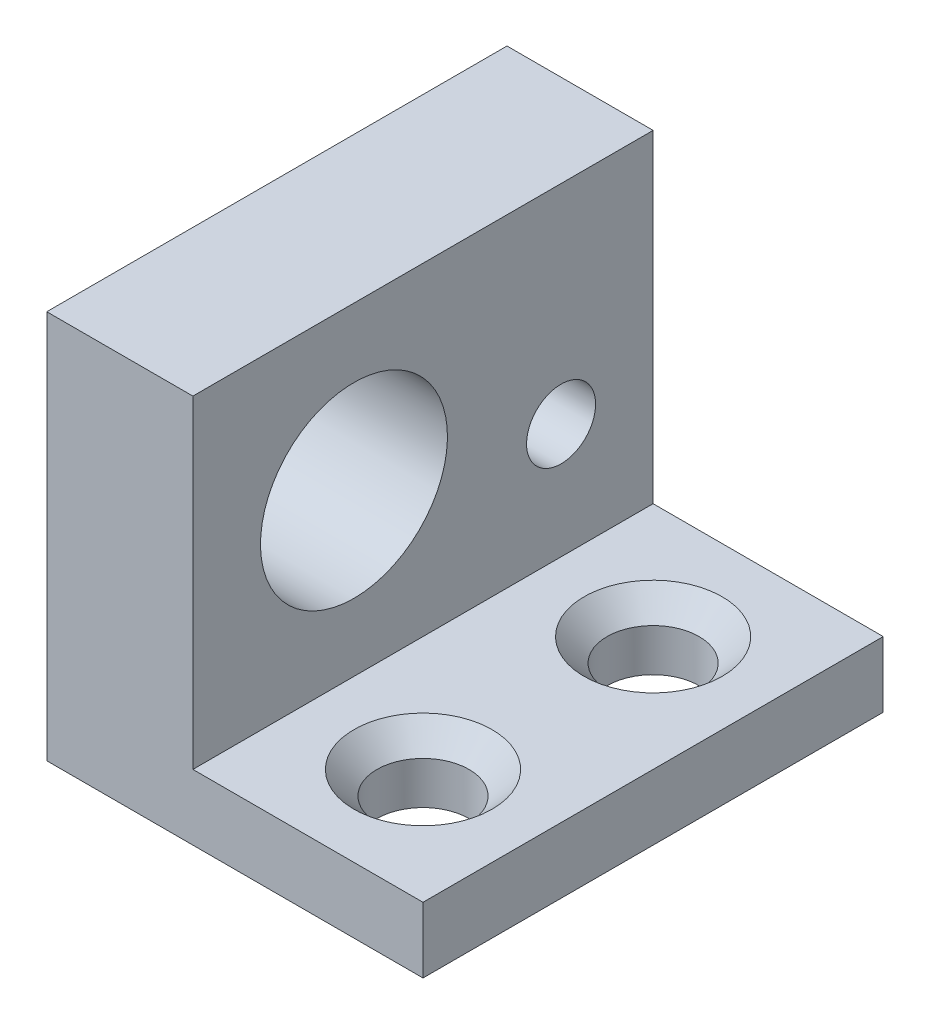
ISO-10303-21;
HEADER;
FILE_DESCRIPTION(('STEP AP214'),'2;1');
FILE_NAME('part.step','',(''),(''),'','','');
FILE_SCHEMA(('AUTOMOTIVE_DESIGN { 1 0 10303 214 1 1 1 1 }'));
ENDSEC;
DATA;
#1=APPLICATION_CONTEXT('core data for automotive mechanical design processes');
#2=APPLICATION_PROTOCOL_DEFINITION('international standard','automotive_design',2000,#1);
#3=PRODUCT_CONTEXT('',#1,'mechanical');
#4=PRODUCT('Part','Part','',(#3));
#5=PRODUCT_RELATED_PRODUCT_CATEGORY('part','',(#4));
#6=PRODUCT_DEFINITION_FORMATION('','',#4);
#7=PRODUCT_DEFINITION_CONTEXT('part definition',#1,'design');
#8=PRODUCT_DEFINITION('design','',#6,#7);
#9=PRODUCT_DEFINITION_SHAPE('','',#8);
#10=(LENGTH_UNIT() NAMED_UNIT(*) SI_UNIT(.MILLI.,.METRE.));
#11=(NAMED_UNIT(*) PLANE_ANGLE_UNIT() SI_UNIT($,.RADIAN.));
#12=(NAMED_UNIT(*) SI_UNIT($,.STERADIAN.) SOLID_ANGLE_UNIT());
#13=UNCERTAINTY_MEASURE_WITH_UNIT(LENGTH_MEASURE(1.E-05),#10,'distance_accuracy_value','');
#14=(GEOMETRIC_REPRESENTATION_CONTEXT(3) GLOBAL_UNCERTAINTY_ASSIGNED_CONTEXT((#13)) GLOBAL_UNIT_ASSIGNED_CONTEXT((#10,
#11,#12)) REPRESENTATION_CONTEXT('',''));
#15=CARTESIAN_POINT('',(0.,0.,0.));
#16=DIRECTION('',(0.,0.,1.));
#17=DIRECTION('',(1.,0.,0.));
#18=AXIS2_PLACEMENT_3D('',#15,#16,#17);
#19=CARTESIAN_POINT('',(0.,25.4,10.));
#20=DIRECTION('',(1.,0.,0.));
#21=DIRECTION('',(0.,1.,0.));
#22=AXIS2_PLACEMENT_3D('',#19,#20,#21);
#23=PLANE('',#22);
#24=CARTESIAN_POINT('',(0.,13.35,3.));
#25=DIRECTION('',(-1.,0.,0.));
#26=DIRECTION('',(0.,-1.,0.));
#27=AXIS2_PLACEMENT_3D('',#24,#25,#26);
#28=CIRCLE('',#27,4.0625);
#29=CARTESIAN_POINT('',(0.,9.2875,3.));
#30=VERTEX_POINT('',#29);
#31=EDGE_CURVE('E166',#30,#30,#28,.T.);
#32=ORIENTED_EDGE('',*,*,#31,.F.);
#33=EDGE_LOOP('',(#32));
#34=FACE_BOUND('',#33,.T.);
#35=CARTESIAN_POINT('',(0.,11.35,-6.));
#36=DIRECTION('',(-1.,0.,0.));
#37=DIRECTION('',(0.,-1.,0.));
#38=AXIS2_PLACEMENT_3D('',#35,#36,#37);
#39=CIRCLE('',#38,1.5);
#40=CARTESIAN_POINT('',(0.,9.85,-6.));
#41=VERTEX_POINT('',#40);
#42=EDGE_CURVE('E172',#41,#41,#39,.T.);
#43=ORIENTED_EDGE('',*,*,#42,.F.);
#44=EDGE_LOOP('',(#43));
#45=FACE_BOUND('',#44,.T.);
#46=DIRECTION('',(0.,0.,1.));
#47=VECTOR('',#46,1.);
#48=CARTESIAN_POINT('',(0.,20.4,-10.));
#49=LINE('',#48,#47);
#50=CARTESIAN_POINT('',(0.,20.4,-10.));
#51=VERTEX_POINT('',#50);
#52=CARTESIAN_POINT('',(0.,20.4,10.));
#53=VERTEX_POINT('',#52);
#54=EDGE_CURVE('E152',#51,#53,#49,.T.);
#55=ORIENTED_EDGE('',*,*,#54,.F.);
#56=DIRECTION('',(0.,-1.,0.));
#57=VECTOR('',#56,1.);
#58=CARTESIAN_POINT('',(0.,25.4,-10.));
#59=LINE('',#58,#57);
#60=CARTESIAN_POINT('',(0.,3.5,-10.));
#61=VERTEX_POINT('',#60);
#62=EDGE_CURVE('E113',#51,#61,#59,.T.);
#63=ORIENTED_EDGE('',*,*,#62,.T.);
#64=DIRECTION('',(0.,0.,-1.));
#65=VECTOR('',#64,1.);
#66=CARTESIAN_POINT('',(0.,3.5,10.));
#67=LINE('',#66,#65);
#68=CARTESIAN_POINT('',(0.,3.5,10.));
#69=VERTEX_POINT('',#68);
#70=EDGE_CURVE('E159',#69,#61,#67,.T.);
#71=ORIENTED_EDGE('',*,*,#70,.F.);
#72=DIRECTION('',(0.,-1.,0.));
#73=VECTOR('',#72,1.);
#74=CARTESIAN_POINT('',(0.,25.4,10.));
#75=LINE('',#74,#73);
#76=EDGE_CURVE('E106',#53,#69,#75,.T.);
#77=ORIENTED_EDGE('',*,*,#76,.F.);
#78=EDGE_LOOP('',(#55,#63,#71,#77));
#79=FACE_BOUND('',#78,.T.);
#80=ADVANCED_FACE('F32',(#34,#45,#79),#23,.F.);
#81=CARTESIAN_POINT('',(0.,0.,10.));
#82=DIRECTION('',(0.,0.,1.));
#83=DIRECTION('',(1.,0.,0.));
#84=AXIS2_PLACEMENT_3D('',#81,#82,#83);
#85=PLANE('',#84);
#86=DIRECTION('',(0.,1.,0.));
#87=VECTOR('',#86,1.);
#88=CARTESIAN_POINT('',(16.35,-23.65,10.));
#89=LINE('',#88,#87);
#90=CARTESIAN_POINT('',(16.35,3.5,10.));
#91=VERTEX_POINT('',#90);
#92=CARTESIAN_POINT('',(16.35,6.35,10.));
#93=VERTEX_POINT('',#92);
#94=EDGE_CURVE('E47',#91,#93,#89,.T.);
#95=ORIENTED_EDGE('',*,*,#94,.T.);
#96=DIRECTION('',(-1.,0.,0.));
#97=VECTOR('',#96,1.);
#98=CARTESIAN_POINT('',(25.4,6.34999999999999,10.));
#99=LINE('',#98,#97);
#100=CARTESIAN_POINT('',(6.35,6.35,10.));
#101=VERTEX_POINT('',#100);
#102=EDGE_CURVE('E96',#93,#101,#99,.T.);
#103=ORIENTED_EDGE('',*,*,#102,.T.);
#104=DIRECTION('',(0.,1.,0.));
#105=VECTOR('',#104,1.);
#106=CARTESIAN_POINT('',(6.35,6.35,10.));
#107=LINE('',#106,#105);
#108=CARTESIAN_POINT('',(6.35,20.4,10.));
#109=VERTEX_POINT('',#108);
#110=EDGE_CURVE('E105',#101,#109,#107,.T.);
#111=ORIENTED_EDGE('',*,*,#110,.T.);
#112=DIRECTION('',(1.,0.,0.));
#113=VECTOR('',#112,1.);
#114=CARTESIAN_POINT('',(0.,20.4,10.));
#115=LINE('',#114,#113);
#116=EDGE_CURVE('E55',#53,#109,#115,.T.);
#117=ORIENTED_EDGE('',*,*,#116,.F.);
#118=ORIENTED_EDGE('',*,*,#76,.T.);
#119=DIRECTION('',(-1.,0.,0.));
#120=VECTOR('',#119,1.);
#121=CARTESIAN_POINT('',(0.,3.5,10.));
#122=LINE('',#121,#120);
#123=EDGE_CURVE('E99',#91,#69,#122,.T.);
#124=ORIENTED_EDGE('',*,*,#123,.F.);
#125=EDGE_LOOP('',(#95,#103,#111,#117,#118,#124));
#126=FACE_BOUND('',#125,.T.);
#127=ADVANCED_FACE('F94',(#126),#85,.T.);
#128=CARTESIAN_POINT('',(0.,0.,-10.));
#129=DIRECTION('',(0.,0.,1.));
#130=DIRECTION('',(1.,0.,0.));
#131=AXIS2_PLACEMENT_3D('',#128,#129,#130);
#132=PLANE('',#131);
#133=DIRECTION('',(-1.,0.,0.));
#134=VECTOR('',#133,1.);
#135=CARTESIAN_POINT('',(25.4,6.34999999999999,-10.));
#136=LINE('',#135,#134);
#137=CARTESIAN_POINT('',(16.35,6.35,-9.99999999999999));
#138=VERTEX_POINT('',#137);
#139=CARTESIAN_POINT('',(6.35,6.35,-10.));
#140=VERTEX_POINT('',#139);
#141=EDGE_CURVE('E115',#138,#140,#136,.T.);
#142=ORIENTED_EDGE('',*,*,#141,.F.);
#143=DIRECTION('',(0.,-1.,0.));
#144=VECTOR('',#143,1.);
#145=CARTESIAN_POINT('',(16.35,0.,-10.));
#146=LINE('',#145,#144);
#147=CARTESIAN_POINT('',(16.35,3.5,-10.));
#148=VERTEX_POINT('',#147);
#149=EDGE_CURVE('E86',#138,#148,#146,.T.);
#150=ORIENTED_EDGE('',*,*,#149,.T.);
#151=DIRECTION('',(1.,0.,0.));
#152=VECTOR('',#151,1.);
#153=CARTESIAN_POINT('',(0.,3.5,-10.));
#154=LINE('',#153,#152);
#155=EDGE_CURVE('E162',#61,#148,#154,.T.);
#156=ORIENTED_EDGE('',*,*,#155,.F.);
#157=ORIENTED_EDGE('',*,*,#62,.F.);
#158=DIRECTION('',(-1.,0.,0.));
#159=VECTOR('',#158,1.);
#160=CARTESIAN_POINT('',(0.,20.4,-10.));
#161=LINE('',#160,#159);
#162=CARTESIAN_POINT('',(6.35,20.4,-10.));
#163=VERTEX_POINT('',#162);
#164=EDGE_CURVE('E157',#163,#51,#161,.T.);
#165=ORIENTED_EDGE('',*,*,#164,.F.);
#166=DIRECTION('',(0.,1.,0.));
#167=VECTOR('',#166,1.);
#168=CARTESIAN_POINT('',(6.35,6.35,-10.));
#169=LINE('',#168,#167);
#170=EDGE_CURVE('E109',#140,#163,#169,.T.);
#171=ORIENTED_EDGE('',*,*,#170,.F.);
#172=EDGE_LOOP('',(#142,#150,#156,#157,#165,#171));
#173=FACE_BOUND('',#172,.T.);
#174=ADVANCED_FACE('F182',(#173),#132,.F.);
#175=CARTESIAN_POINT('',(6.35,6.35,10.));
#176=DIRECTION('',(-1.,0.,0.));
#177=DIRECTION('',(0.,0.,1.));
#178=AXIS2_PLACEMENT_3D('',#175,#176,#177);
#179=PLANE('',#178);
#180=CARTESIAN_POINT('',(6.35,11.35,-6.));
#181=DIRECTION('',(-1.,0.,0.));
#182=DIRECTION('',(0.,0.,1.));
#183=AXIS2_PLACEMENT_3D('',#180,#181,#182);
#184=CIRCLE('',#183,1.5);
#185=CARTESIAN_POINT('',(6.35,9.85,-6.));
#186=VERTEX_POINT('',#185);
#187=EDGE_CURVE('E116',#186,#186,#184,.F.);
#188=ORIENTED_EDGE('',*,*,#187,.F.);
#189=EDGE_LOOP('',(#188));
#190=FACE_BOUND('',#189,.T.);
#191=CARTESIAN_POINT('',(6.35,13.35,3.));
#192=DIRECTION('',(-1.,0.,0.));
#193=DIRECTION('',(0.,0.,1.));
#194=AXIS2_PLACEMENT_3D('',#191,#192,#193);
#195=CIRCLE('',#194,4.0625);
#196=CARTESIAN_POINT('',(6.35,9.28749999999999,3.));
#197=VERTEX_POINT('',#196);
#198=EDGE_CURVE('E169',#197,#197,#195,.F.);
#199=ORIENTED_EDGE('',*,*,#198,.F.);
#200=EDGE_LOOP('',(#199));
#201=FACE_BOUND('',#200,.T.);
#202=DIRECTION('',(0.,0.,-1.));
#203=VECTOR('',#202,1.);
#204=CARTESIAN_POINT('',(6.35,20.4,-10.));
#205=LINE('',#204,#203);
#206=EDGE_CURVE('E155',#109,#163,#205,.T.);
#207=ORIENTED_EDGE('',*,*,#206,.F.);
#208=ORIENTED_EDGE('',*,*,#110,.F.);
#209=DIRECTION('',(0.,0.,-1.));
#210=VECTOR('',#209,1.);
#211=CARTESIAN_POINT('',(6.35,6.35,10.));
#212=LINE('',#211,#210);
#213=EDGE_CURVE('E103',#101,#140,#212,.T.);
#214=ORIENTED_EDGE('',*,*,#213,.T.);
#215=ORIENTED_EDGE('',*,*,#170,.T.);
#216=EDGE_LOOP('',(#207,#208,#214,#215));
#217=FACE_BOUND('',#216,.T.);
#218=ADVANCED_FACE('F179',(#190,#201,#217),#179,.F.);
#219=CARTESIAN_POINT('',(25.4,6.34999999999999,10.));
#220=DIRECTION('',(0.,-1.,0.));
#221=DIRECTION('',(1.,0.,0.));
#222=AXIS2_PLACEMENT_3D('',#219,#220,#221);
#223=PLANE('',#222);
#224=CARTESIAN_POINT('',(11.35,6.35,-5.));
#225=DIRECTION('',(0.,-1.,0.));
#226=DIRECTION('',(1.,0.,0.));
#227=AXIS2_PLACEMENT_3D('',#224,#225,#226);
#228=CIRCLE('',#227,3.00000000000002);
#229=CARTESIAN_POINT('',(14.35,6.35,-5.));
#230=VERTEX_POINT('',#229);
#231=EDGE_CURVE('E40',#230,#230,#228,.T.);
#232=ORIENTED_EDGE('',*,*,#231,.T.);
#233=EDGE_LOOP('',(#232));
#234=FACE_BOUND('',#233,.T.);
#235=CARTESIAN_POINT('',(11.35,6.35,5.));
#236=DIRECTION('',(0.,-1.,0.));
#237=DIRECTION('',(1.,0.,0.));
#238=AXIS2_PLACEMENT_3D('',#235,#236,#237);
#239=CIRCLE('',#238,3.00000000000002);
#240=CARTESIAN_POINT('',(14.35,6.35,5.));
#241=VERTEX_POINT('',#240);
#242=EDGE_CURVE('E126',#241,#241,#239,.T.);
#243=ORIENTED_EDGE('',*,*,#242,.T.);
#244=EDGE_LOOP('',(#243));
#245=FACE_BOUND('',#244,.T.);
#246=ORIENTED_EDGE('',*,*,#102,.F.);
#247=DIRECTION('',(0.,0.,1.));
#248=VECTOR('',#247,1.);
#249=CARTESIAN_POINT('',(16.35,6.35,-44.5));
#250=LINE('',#249,#248);
#251=EDGE_CURVE('E83',#138,#93,#250,.T.);
#252=ORIENTED_EDGE('',*,*,#251,.F.);
#253=ORIENTED_EDGE('',*,*,#141,.T.);
#254=ORIENTED_EDGE('',*,*,#213,.F.);
#255=EDGE_LOOP('',(#246,#252,#253,#254));
#256=FACE_BOUND('',#255,.T.);
#257=ADVANCED_FACE('F101',(#234,#245,#256),#223,.F.);
#258=CARTESIAN_POINT('',(25.401,11.35,-6.));
#259=DIRECTION('',(-1.,0.,0.));
#260=DIRECTION('',(0.,-1.,0.));
#261=AXIS2_PLACEMENT_3D('',#258,#259,#260);
#262=CYLINDRICAL_SURFACE('',#261,1.5);
#263=CARTESIAN_POINT('',(0.,9.85,-6.));
#264=CARTESIAN_POINT('',(0.0661458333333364,9.85,-6.));
#265=CARTESIAN_POINT('',(0.132291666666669,9.85,-6.));
#266=CARTESIAN_POINT('',(0.264583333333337,9.85,-6.));
#267=CARTESIAN_POINT('',(0.330729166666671,9.85,-6.));
#268=CARTESIAN_POINT('',(0.463020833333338,9.85,-6.));
#269=CARTESIAN_POINT('',(0.529166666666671,9.85,-6.));
#270=CARTESIAN_POINT('',(0.661458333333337,9.85,-6.));
#271=CARTESIAN_POINT('',(0.72760416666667,9.85,-6.));
#272=CARTESIAN_POINT('',(0.859895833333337,9.85,-6.));
#273=CARTESIAN_POINT('',(0.926041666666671,9.85,-6.));
#274=CARTESIAN_POINT('',(1.05833333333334,9.85,-6.));
#275=CARTESIAN_POINT('',(1.12447916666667,9.85,-6.));
#276=CARTESIAN_POINT('',(1.25677083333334,9.85,-6.));
#277=CARTESIAN_POINT('',(1.32291666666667,9.85,-6.));
#278=CARTESIAN_POINT('',(1.45520833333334,9.85,-6.));
#279=CARTESIAN_POINT('',(1.52135416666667,9.85,-6.));
#280=CARTESIAN_POINT('',(1.65364583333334,9.85,-6.));
#281=CARTESIAN_POINT('',(1.71979166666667,9.85,-6.));
#282=CARTESIAN_POINT('',(1.85208333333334,9.85,-6.));
#283=CARTESIAN_POINT('',(1.91822916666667,9.85,-6.));
#284=CARTESIAN_POINT('',(2.05052083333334,9.85,-6.));
#285=CARTESIAN_POINT('',(2.11666666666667,9.85,-6.));
#286=CARTESIAN_POINT('',(2.24895833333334,9.85,-6.));
#287=CARTESIAN_POINT('',(2.31510416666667,9.85,-6.));
#288=CARTESIAN_POINT('',(2.44739583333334,9.85,-6.));
#289=CARTESIAN_POINT('',(2.51354166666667,9.85,-6.));
#290=CARTESIAN_POINT('',(2.64583333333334,9.85,-6.));
#291=CARTESIAN_POINT('',(2.71197916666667,9.85,-6.));
#292=CARTESIAN_POINT('',(2.84427083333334,9.85,-6.));
#293=CARTESIAN_POINT('',(2.91041666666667,9.85,-6.));
#294=CARTESIAN_POINT('',(3.04270833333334,9.85,-6.));
#295=CARTESIAN_POINT('',(3.10885416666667,9.85,-6.));
#296=CARTESIAN_POINT('',(3.24114583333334,9.85,-6.));
#297=CARTESIAN_POINT('',(3.30729166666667,9.85,-6.));
#298=CARTESIAN_POINT('',(3.43958333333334,9.85,-6.));
#299=CARTESIAN_POINT('',(3.50572916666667,9.85,-6.));
#300=CARTESIAN_POINT('',(3.63802083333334,9.85,-6.));
#301=CARTESIAN_POINT('',(3.70416666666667,9.85,-6.));
#302=CARTESIAN_POINT('',(3.83645833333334,9.85,-6.));
#303=CARTESIAN_POINT('',(3.90260416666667,9.85,-6.));
#304=CARTESIAN_POINT('',(4.03489583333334,9.85,-6.));
#305=CARTESIAN_POINT('',(4.10104166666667,9.85,-6.));
#306=CARTESIAN_POINT('',(4.23333333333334,9.85,-6.));
#307=CARTESIAN_POINT('',(4.29947916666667,9.85,-6.));
#308=CARTESIAN_POINT('',(4.43177083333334,9.85,-6.));
#309=CARTESIAN_POINT('',(4.49791666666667,9.85,-6.));
#310=CARTESIAN_POINT('',(4.63020833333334,9.85,-6.));
#311=CARTESIAN_POINT('',(4.69635416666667,9.85,-6.));
#312=CARTESIAN_POINT('',(4.82864583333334,9.85,-6.));
#313=CARTESIAN_POINT('',(4.89479166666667,9.85,-6.));
#314=CARTESIAN_POINT('',(5.02708333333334,9.85,-6.));
#315=CARTESIAN_POINT('',(5.09322916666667,9.85,-6.));
#316=CARTESIAN_POINT('',(5.22552083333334,9.85,-6.));
#317=CARTESIAN_POINT('',(5.29166666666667,9.85,-6.));
#318=CARTESIAN_POINT('',(5.42395833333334,9.85,-6.));
#319=CARTESIAN_POINT('',(5.49010416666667,9.85,-6.));
#320=CARTESIAN_POINT('',(5.62239583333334,9.85,-6.));
#321=CARTESIAN_POINT('',(5.68854166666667,9.85,-6.));
#322=CARTESIAN_POINT('',(5.82083333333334,9.85,-6.));
#323=CARTESIAN_POINT('',(5.88697916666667,9.85,-6.));
#324=CARTESIAN_POINT('',(6.01927083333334,9.85,-6.));
#325=CARTESIAN_POINT('',(6.08541666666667,9.85,-6.));
#326=CARTESIAN_POINT('',(6.21770833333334,9.85,-6.));
#327=CARTESIAN_POINT('',(6.28385416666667,9.85,-6.));
#328=CARTESIAN_POINT('',(6.35,9.85,-6.));
#329=B_SPLINE_CURVE_WITH_KNOTS('',3,(#263,#264,#265,#266,#267,#268,#269,#270,#271,#272,#273,
#274,#275,#276,#277,#278,#279,#280,#281,#282,#283,#284,#285,#286,#287,#288,#289,#290,#291,#292,
#293,#294,#295,#296,#297,#298,#299,#300,#301,#302,#303,#304,#305,#306,#307,#308,#309,#310,#311,
#312,#313,#314,#315,#316,#317,#318,#319,#320,#321,#322,#323,#324,#325,#326,#327,#328),
.UNSPECIFIED.,.F.,.F.,(4,2,2,2,2,2,2,2,2,2,2,2,2,2,2,2,2,2,2,2,2,2,2,2,2,2,2,2,2,2,2,2,4),(0.,
0.198437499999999,0.396875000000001,0.5953125,0.793749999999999,0.992187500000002,1.190625,
1.3890625,1.5875,1.7859375,1.984375,2.1828125,2.38125,2.5796875,2.778125,2.9765625,3.175,
3.3734375,3.571875,3.7703125,3.96875,4.1671875,4.365625,4.5640625,4.7625,4.9609375,5.159375,
5.3578125,5.55625,5.7546875,5.953125,6.1515625,6.35),.UNSPECIFIED.);
#330=EDGE_CURVE('BSEAM177',#41,#186,#329,.T.);
#331=ORIENTED_EDGE('',*,*,#42,.T.);
#332=ORIENTED_EDGE('',*,*,#187,.T.);
#333=ORIENTED_EDGE('',*,*,#330,.T.);
#334=ORIENTED_EDGE('',*,*,#330,.F.);
#335=EDGE_LOOP('',(#331,#333,#332,#334));
#336=FACE_BOUND('',#335,.T.);
#337=ADVANCED_FACE('F177',(#336),#262,.F.);
#338=CARTESIAN_POINT('',(25.401,13.35,3.));
#339=DIRECTION('',(-1.,0.,0.));
#340=DIRECTION('',(0.,-1.,0.));
#341=AXIS2_PLACEMENT_3D('',#338,#339,#340);
#342=CYLINDRICAL_SURFACE('',#341,4.0625);
#343=CARTESIAN_POINT('',(0.,9.2875,3.));
#344=CARTESIAN_POINT('',(0.0661458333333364,9.2875,3.));
#345=CARTESIAN_POINT('',(0.132291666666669,9.2875,3.));
#346=CARTESIAN_POINT('',(0.264583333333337,9.2875,3.));
#347=CARTESIAN_POINT('',(0.330729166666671,9.2875,3.));
#348=CARTESIAN_POINT('',(0.463020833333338,9.2875,3.));
#349=CARTESIAN_POINT('',(0.529166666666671,9.2875,3.));
#350=CARTESIAN_POINT('',(0.661458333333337,9.2875,3.));
#351=CARTESIAN_POINT('',(0.72760416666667,9.2875,3.));
#352=CARTESIAN_POINT('',(0.859895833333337,9.2875,3.));
#353=CARTESIAN_POINT('',(0.926041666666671,9.2875,3.));
#354=CARTESIAN_POINT('',(1.05833333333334,9.2875,3.));
#355=CARTESIAN_POINT('',(1.12447916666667,9.2875,3.));
#356=CARTESIAN_POINT('',(1.25677083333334,9.2875,3.));
#357=CARTESIAN_POINT('',(1.32291666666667,9.2875,3.));
#358=CARTESIAN_POINT('',(1.45520833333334,9.2875,3.));
#359=CARTESIAN_POINT('',(1.52135416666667,9.2875,3.));
#360=CARTESIAN_POINT('',(1.65364583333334,9.2875,3.));
#361=CARTESIAN_POINT('',(1.71979166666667,9.2875,3.));
#362=CARTESIAN_POINT('',(1.85208333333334,9.2875,3.));
#363=CARTESIAN_POINT('',(1.91822916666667,9.2875,3.));
#364=CARTESIAN_POINT('',(2.05052083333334,9.2875,3.));
#365=CARTESIAN_POINT('',(2.11666666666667,9.2875,3.));
#366=CARTESIAN_POINT('',(2.24895833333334,9.2875,3.));
#367=CARTESIAN_POINT('',(2.31510416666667,9.2875,3.));
#368=CARTESIAN_POINT('',(2.44739583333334,9.2875,3.));
#369=CARTESIAN_POINT('',(2.51354166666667,9.2875,3.));
#370=CARTESIAN_POINT('',(2.64583333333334,9.2875,3.));
#371=CARTESIAN_POINT('',(2.71197916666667,9.2875,3.));
#372=CARTESIAN_POINT('',(2.84427083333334,9.2875,3.));
#373=CARTESIAN_POINT('',(2.91041666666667,9.2875,3.));
#374=CARTESIAN_POINT('',(3.04270833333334,9.2875,3.));
#375=CARTESIAN_POINT('',(3.10885416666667,9.2875,3.));
#376=CARTESIAN_POINT('',(3.24114583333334,9.2875,3.));
#377=CARTESIAN_POINT('',(3.30729166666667,9.2875,3.));
#378=CARTESIAN_POINT('',(3.43958333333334,9.2875,3.));
#379=CARTESIAN_POINT('',(3.50572916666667,9.28749999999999,3.));
#380=CARTESIAN_POINT('',(3.63802083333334,9.28749999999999,3.));
#381=CARTESIAN_POINT('',(3.70416666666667,9.28749999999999,3.));
#382=CARTESIAN_POINT('',(3.83645833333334,9.28749999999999,3.));
#383=CARTESIAN_POINT('',(3.90260416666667,9.28749999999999,3.));
#384=CARTESIAN_POINT('',(4.03489583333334,9.28749999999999,3.));
#385=CARTESIAN_POINT('',(4.10104166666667,9.28749999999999,3.));
#386=CARTESIAN_POINT('',(4.23333333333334,9.28749999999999,3.));
#387=CARTESIAN_POINT('',(4.29947916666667,9.28749999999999,3.));
#388=CARTESIAN_POINT('',(4.43177083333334,9.28749999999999,3.));
#389=CARTESIAN_POINT('',(4.49791666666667,9.28749999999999,3.));
#390=CARTESIAN_POINT('',(4.63020833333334,9.28749999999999,3.));
#391=CARTESIAN_POINT('',(4.69635416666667,9.28749999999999,3.));
#392=CARTESIAN_POINT('',(4.82864583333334,9.28749999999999,3.));
#393=CARTESIAN_POINT('',(4.89479166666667,9.28749999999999,3.));
#394=CARTESIAN_POINT('',(5.02708333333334,9.28749999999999,3.));
#395=CARTESIAN_POINT('',(5.09322916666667,9.28749999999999,3.));
#396=CARTESIAN_POINT('',(5.22552083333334,9.28749999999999,3.));
#397=CARTESIAN_POINT('',(5.29166666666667,9.28749999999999,3.));
#398=CARTESIAN_POINT('',(5.42395833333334,9.28749999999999,3.));
#399=CARTESIAN_POINT('',(5.49010416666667,9.28749999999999,3.));
#400=CARTESIAN_POINT('',(5.62239583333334,9.28749999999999,3.));
#401=CARTESIAN_POINT('',(5.68854166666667,9.28749999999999,3.));
#402=CARTESIAN_POINT('',(5.82083333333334,9.28749999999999,3.));
#403=CARTESIAN_POINT('',(5.88697916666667,9.28749999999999,3.));
#404=CARTESIAN_POINT('',(6.01927083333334,9.28749999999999,3.));
#405=CARTESIAN_POINT('',(6.08541666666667,9.28749999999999,3.));
#406=CARTESIAN_POINT('',(6.21770833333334,9.28749999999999,3.));
#407=CARTESIAN_POINT('',(6.28385416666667,9.28749999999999,3.));
#408=CARTESIAN_POINT('',(6.35,9.28749999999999,3.));
#409=B_SPLINE_CURVE_WITH_KNOTS('',3,(#343,#344,#345,#346,#347,#348,#349,#350,#351,#352,#353,
#354,#355,#356,#357,#358,#359,#360,#361,#362,#363,#364,#365,#366,#367,#368,#369,#370,#371,#372,
#373,#374,#375,#376,#377,#378,#379,#380,#381,#382,#383,#384,#385,#386,#387,#388,#389,#390,#391,
#392,#393,#394,#395,#396,#397,#398,#399,#400,#401,#402,#403,#404,#405,#406,#407,#408),
.UNSPECIFIED.,.F.,.F.,(4,2,2,2,2,2,2,2,2,2,2,2,2,2,2,2,2,2,2,2,2,2,2,2,2,2,2,2,2,2,2,2,4),(0.,
0.198437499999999,0.396875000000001,0.5953125,0.793749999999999,0.992187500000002,1.190625,
1.3890625,1.5875,1.7859375,1.984375,2.1828125,2.38125,2.5796875,2.778125,2.9765625,3.175,
3.3734375,3.571875,3.7703125,3.96875,4.1671875,4.365625,4.5640625,4.7625,4.9609375,5.159375,
5.3578125,5.55625,5.7546875,5.953125,6.1515625,6.35),.UNSPECIFIED.);
#410=EDGE_CURVE('BSEAM205',#30,#197,#409,.T.);
#411=ORIENTED_EDGE('',*,*,#31,.T.);
#412=ORIENTED_EDGE('',*,*,#198,.T.);
#413=ORIENTED_EDGE('',*,*,#410,.T.);
#414=ORIENTED_EDGE('',*,*,#410,.F.);
#415=EDGE_LOOP('',(#411,#413,#412,#414));
#416=FACE_BOUND('',#415,.T.);
#417=ADVANCED_FACE('F205',(#416),#342,.F.);
#418=CARTESIAN_POINT('',(0.,3.5,0.));
#419=DIRECTION('',(0.,-1.,0.));
#420=DIRECTION('',(0.,0.,-1.));
#421=AXIS2_PLACEMENT_3D('',#418,#419,#420);
#422=PLANE('',#421);
#423=CARTESIAN_POINT('',(11.35,3.5,-5.));
#424=DIRECTION('',(0.,-1.,0.));
#425=DIRECTION('',(0.,0.,-1.));
#426=AXIS2_PLACEMENT_3D('',#423,#424,#425);
#427=CIRCLE('',#426,2.);
#428=CARTESIAN_POINT('',(9.35,3.5,-5.));
#429=VERTEX_POINT('',#428);
#430=EDGE_CURVE('E145',#429,#429,#427,.F.);
#431=ORIENTED_EDGE('',*,*,#430,.T.);
#432=EDGE_LOOP('',(#431));
#433=FACE_BOUND('',#432,.T.);
#434=CARTESIAN_POINT('',(11.35,3.5,5.));
#435=DIRECTION('',(0.,-1.,0.));
#436=DIRECTION('',(0.,0.,-1.));
#437=AXIS2_PLACEMENT_3D('',#434,#435,#436);
#438=CIRCLE('',#437,2.);
#439=CARTESIAN_POINT('',(9.35,3.5,5.));
#440=VERTEX_POINT('',#439);
#441=EDGE_CURVE('E90',#440,#440,#438,.F.);
#442=ORIENTED_EDGE('',*,*,#441,.T.);
#443=EDGE_LOOP('',(#442));
#444=FACE_BOUND('',#443,.T.);
#445=DIRECTION('',(0.,0.,-1.));
#446=VECTOR('',#445,1.);
#447=CARTESIAN_POINT('',(16.35,3.5,0.));
#448=LINE('',#447,#446);
#449=EDGE_CURVE('E121',#91,#148,#448,.T.);
#450=ORIENTED_EDGE('',*,*,#449,.F.);
#451=ORIENTED_EDGE('',*,*,#123,.T.);
#452=ORIENTED_EDGE('',*,*,#70,.T.);
#453=ORIENTED_EDGE('',*,*,#155,.T.);
#454=EDGE_LOOP('',(#450,#451,#452,#453));
#455=FACE_BOUND('',#454,.T.);
#456=ADVANCED_FACE('F195',(#433,#444,#455),#422,.T.);
#457=CARTESIAN_POINT('',(0.,20.4,0.));
#458=DIRECTION('',(0.,1.,0.));
#459=DIRECTION('',(0.,0.,1.));
#460=AXIS2_PLACEMENT_3D('',#457,#458,#459);
#461=PLANE('',#460);
#462=ORIENTED_EDGE('',*,*,#54,.T.);
#463=ORIENTED_EDGE('',*,*,#116,.T.);
#464=ORIENTED_EDGE('',*,*,#206,.T.);
#465=ORIENTED_EDGE('',*,*,#164,.T.);
#466=EDGE_LOOP('',(#462,#463,#464,#465));
#467=FACE_BOUND('',#466,.T.);
#468=ADVANCED_FACE('F197',(#467),#461,.T.);
#469=CARTESIAN_POINT('',(16.35,-23.65,-44.5));
#470=DIRECTION('',(-1.,0.,0.));
#471=DIRECTION('',(0.,-1.,0.));
#472=AXIS2_PLACEMENT_3D('',#469,#470,#471);
#473=PLANE('',#472);
#474=ORIENTED_EDGE('',*,*,#251,.T.);
#475=ORIENTED_EDGE('',*,*,#94,.F.);
#476=ORIENTED_EDGE('',*,*,#449,.T.);
#477=ORIENTED_EDGE('',*,*,#149,.F.);
#478=EDGE_LOOP('',(#474,#475,#476,#477));
#479=FACE_BOUND('',#478,.T.);
#480=ADVANCED_FACE('F84',(#479),#473,.F.);
#481=CARTESIAN_POINT('',(11.35,3.499,5.));
#482=DIRECTION('',(0.,1.,0.));
#483=DIRECTION('',(-1.,0.,0.));
#484=AXIS2_PLACEMENT_3D('',#481,#482,#483);
#485=CYLINDRICAL_SURFACE('',#484,2.);
#486=CARTESIAN_POINT('',(11.35,5.34999999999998,5.));
#487=DIRECTION('',(0.,-1.,0.));
#488=DIRECTION('',(0.,0.,-1.));
#489=AXIS2_PLACEMENT_3D('',#486,#487,#488);
#490=CIRCLE('',#489,2.);
#491=CARTESIAN_POINT('',(9.35,5.34999999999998,5.));
#492=VERTEX_POINT('',#491);
#493=EDGE_CURVE('E11',#492,#492,#490,.F.);
#494=CARTESIAN_POINT('',(9.35,5.34999999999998,5.));
#495=CARTESIAN_POINT('',(9.35,5.33072916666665,5.));
#496=CARTESIAN_POINT('',(9.35,5.31145833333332,5.));
#497=CARTESIAN_POINT('',(9.35,5.27291666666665,5.));
#498=CARTESIAN_POINT('',(9.35,5.25364583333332,5.));
#499=CARTESIAN_POINT('',(9.35,5.21510416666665,5.));
#500=CARTESIAN_POINT('',(9.35,5.19583333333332,5.));
#501=CARTESIAN_POINT('',(9.35,5.15729166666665,5.));
#502=CARTESIAN_POINT('',(9.35,5.13802083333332,5.));
#503=CARTESIAN_POINT('',(9.35,5.09947916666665,5.));
#504=CARTESIAN_POINT('',(9.35,5.08020833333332,5.));
#505=CARTESIAN_POINT('',(9.35,5.04166666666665,5.));
#506=CARTESIAN_POINT('',(9.35,5.02239583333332,5.));
#507=CARTESIAN_POINT('',(9.35,4.98385416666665,5.));
#508=CARTESIAN_POINT('',(9.35,4.96458333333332,5.));
#509=CARTESIAN_POINT('',(9.35,4.92604166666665,5.));
#510=CARTESIAN_POINT('',(9.35,4.90677083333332,5.));
#511=CARTESIAN_POINT('',(9.35,4.86822916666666,5.));
#512=CARTESIAN_POINT('',(9.35,4.84895833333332,5.));
#513=CARTESIAN_POINT('',(9.35,4.81041666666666,5.));
#514=CARTESIAN_POINT('',(9.35,4.79114583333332,5.));
#515=CARTESIAN_POINT('',(9.35,4.75260416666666,5.));
#516=CARTESIAN_POINT('',(9.35,4.73333333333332,5.));
#517=CARTESIAN_POINT('',(9.35,4.69479166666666,5.));
#518=CARTESIAN_POINT('',(9.35,4.67552083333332,5.));
#519=CARTESIAN_POINT('',(9.35,4.63697916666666,5.));
#520=CARTESIAN_POINT('',(9.35,4.61770833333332,5.));
#521=CARTESIAN_POINT('',(9.35,4.57916666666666,5.));
#522=CARTESIAN_POINT('',(9.35,4.55989583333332,5.));
#523=CARTESIAN_POINT('',(9.35,4.52135416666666,5.));
#524=CARTESIAN_POINT('',(9.35,4.50208333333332,5.));
#525=CARTESIAN_POINT('',(9.35,4.46354166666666,5.));
#526=CARTESIAN_POINT('',(9.35,4.44427083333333,5.));
#527=CARTESIAN_POINT('',(9.35,4.40572916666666,5.));
#528=CARTESIAN_POINT('',(9.35,4.38645833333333,5.));
#529=CARTESIAN_POINT('',(9.35,4.34791666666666,5.));
#530=CARTESIAN_POINT('',(9.35,4.32864583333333,5.));
#531=CARTESIAN_POINT('',(9.35,4.29010416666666,5.));
#532=CARTESIAN_POINT('',(9.35,4.27083333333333,5.));
#533=CARTESIAN_POINT('',(9.35,4.23229166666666,5.));
#534=CARTESIAN_POINT('',(9.35,4.21302083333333,5.));
#535=CARTESIAN_POINT('',(9.35,4.17447916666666,5.));
#536=CARTESIAN_POINT('',(9.35,4.15520833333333,5.));
#537=CARTESIAN_POINT('',(9.35,4.11666666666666,5.));
#538=CARTESIAN_POINT('',(9.35,4.09739583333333,5.));
#539=CARTESIAN_POINT('',(9.35,4.05885416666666,5.));
#540=CARTESIAN_POINT('',(9.35,4.03958333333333,5.));
#541=CARTESIAN_POINT('',(9.35,4.00104166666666,5.));
#542=CARTESIAN_POINT('',(9.35,3.98177083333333,5.));
#543=CARTESIAN_POINT('',(9.35,3.94322916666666,5.));
#544=CARTESIAN_POINT('',(9.35,3.92395833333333,5.));
#545=CARTESIAN_POINT('',(9.35,3.88541666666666,5.));
#546=CARTESIAN_POINT('',(9.35,3.86614583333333,5.));
#547=CARTESIAN_POINT('',(9.35,3.82760416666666,5.));
#548=CARTESIAN_POINT('',(9.35,3.80833333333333,5.));
#549=CARTESIAN_POINT('',(9.35,3.76979166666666,5.));
#550=CARTESIAN_POINT('',(9.35,3.75052083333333,5.));
#551=CARTESIAN_POINT('',(9.35,3.71197916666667,5.));
#552=CARTESIAN_POINT('',(9.35,3.69270833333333,5.));
#553=CARTESIAN_POINT('',(9.35,3.65416666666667,5.));
#554=CARTESIAN_POINT('',(9.35,3.63489583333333,5.));
#555=CARTESIAN_POINT('',(9.35,3.59635416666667,5.));
#556=CARTESIAN_POINT('',(9.35,3.57708333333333,5.));
#557=CARTESIAN_POINT('',(9.35,3.53854166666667,5.));
#558=CARTESIAN_POINT('',(9.35,3.51927083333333,5.));
#559=CARTESIAN_POINT('',(9.35,3.5,5.));
#560=B_SPLINE_CURVE_WITH_KNOTS('',3,(#494,#495,#496,#497,#498,#499,#500,#501,#502,#503,#504,
#505,#506,#507,#508,#509,#510,#511,#512,#513,#514,#515,#516,#517,#518,#519,#520,#521,#522,#523,
#524,#525,#526,#527,#528,#529,#530,#531,#532,#533,#534,#535,#536,#537,#538,#539,#540,#541,#542,
#543,#544,#545,#546,#547,#548,#549,#550,#551,#552,#553,#554,#555,#556,#557,#558,#559),
.UNSPECIFIED.,.F.,.F.,(4,2,2,2,2,2,2,2,2,2,2,2,2,2,2,2,2,2,2,2,2,2,2,2,2,2,2,2,2,2,2,2,4),(0.,
0.0578124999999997,0.115624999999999,0.173437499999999,0.231249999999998,0.289062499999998,
0.346874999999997,0.404687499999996,0.462499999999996,0.520312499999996,0.578124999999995,
0.635937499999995,0.693749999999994,0.751562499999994,0.809374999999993,0.867187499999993,
0.924999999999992,0.982812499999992,1.04062499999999,1.09843749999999,1.15624999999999,
1.21406249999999,1.27187499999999,1.32968749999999,1.38749999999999,1.44531249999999,
1.50312499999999,1.56093749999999,1.61874999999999,1.67656249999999,1.73437499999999,
1.79218749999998,1.84999999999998),.UNSPECIFIED.);
#561=EDGE_CURVE('BSEAM141',#492,#440,#560,.T.);
#562=ORIENTED_EDGE('',*,*,#493,.T.);
#563=ORIENTED_EDGE('',*,*,#441,.F.);
#564=ORIENTED_EDGE('',*,*,#561,.T.);
#565=ORIENTED_EDGE('',*,*,#561,.F.);
#566=EDGE_LOOP('',(#562,#564,#563,#565));
#567=FACE_BOUND('',#566,.T.);
#568=ADVANCED_FACE('F141',(#567),#485,.F.);
#569=CARTESIAN_POINT('',(11.35,3.499,-5.));
#570=DIRECTION('',(0.,1.,0.));
#571=DIRECTION('',(-1.,0.,0.));
#572=AXIS2_PLACEMENT_3D('',#569,#570,#571);
#573=CYLINDRICAL_SURFACE('',#572,2.);
#574=CARTESIAN_POINT('',(11.35,5.34999999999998,-5.));
#575=DIRECTION('',(0.,-1.,0.));
#576=DIRECTION('',(0.,0.,-1.));
#577=AXIS2_PLACEMENT_3D('',#574,#575,#576);
#578=CIRCLE('',#577,2.);
#579=CARTESIAN_POINT('',(9.35,5.34999999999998,-5.));
#580=VERTEX_POINT('',#579);
#581=EDGE_CURVE('E123',#580,#580,#578,.F.);
#582=CARTESIAN_POINT('',(9.35,5.34999999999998,-5.));
#583=CARTESIAN_POINT('',(9.35,5.33072916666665,-5.));
#584=CARTESIAN_POINT('',(9.35,5.31145833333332,-5.));
#585=CARTESIAN_POINT('',(9.35,5.27291666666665,-5.));
#586=CARTESIAN_POINT('',(9.35,5.25364583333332,-5.));
#587=CARTESIAN_POINT('',(9.35,5.21510416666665,-5.));
#588=CARTESIAN_POINT('',(9.35,5.19583333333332,-5.));
#589=CARTESIAN_POINT('',(9.35,5.15729166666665,-5.));
#590=CARTESIAN_POINT('',(9.35,5.13802083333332,-5.));
#591=CARTESIAN_POINT('',(9.35,5.09947916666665,-5.));
#592=CARTESIAN_POINT('',(9.35,5.08020833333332,-5.));
#593=CARTESIAN_POINT('',(9.35,5.04166666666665,-5.));
#594=CARTESIAN_POINT('',(9.35,5.02239583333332,-5.));
#595=CARTESIAN_POINT('',(9.35,4.98385416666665,-5.));
#596=CARTESIAN_POINT('',(9.35,4.96458333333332,-5.));
#597=CARTESIAN_POINT('',(9.35,4.92604166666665,-5.));
#598=CARTESIAN_POINT('',(9.35,4.90677083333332,-5.));
#599=CARTESIAN_POINT('',(9.35,4.86822916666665,-5.));
#600=CARTESIAN_POINT('',(9.35,4.84895833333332,-5.));
#601=CARTESIAN_POINT('',(9.35,4.81041666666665,-5.));
#602=CARTESIAN_POINT('',(9.35,4.79114583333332,-5.));
#603=CARTESIAN_POINT('',(9.35,4.75260416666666,-5.));
#604=CARTESIAN_POINT('',(9.35,4.73333333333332,-5.));
#605=CARTESIAN_POINT('',(9.35,4.69479166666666,-5.));
#606=CARTESIAN_POINT('',(9.35,4.67552083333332,-5.));
#607=CARTESIAN_POINT('',(9.35,4.63697916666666,-5.));
#608=CARTESIAN_POINT('',(9.35,4.61770833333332,-5.));
#609=CARTESIAN_POINT('',(9.35,4.57916666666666,-5.));
#610=CARTESIAN_POINT('',(9.35,4.55989583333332,-5.));
#611=CARTESIAN_POINT('',(9.35,4.52135416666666,-5.));
#612=CARTESIAN_POINT('',(9.35,4.50208333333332,-5.));
#613=CARTESIAN_POINT('',(9.35,4.46354166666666,-5.));
#614=CARTESIAN_POINT('',(9.35,4.44427083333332,-5.));
#615=CARTESIAN_POINT('',(9.35,4.40572916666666,-5.));
#616=CARTESIAN_POINT('',(9.35,4.38645833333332,-5.));
#617=CARTESIAN_POINT('',(9.35,4.34791666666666,-5.));
#618=CARTESIAN_POINT('',(9.35,4.32864583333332,-5.));
#619=CARTESIAN_POINT('',(9.35,4.29010416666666,-5.));
#620=CARTESIAN_POINT('',(9.35,4.27083333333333,-5.));
#621=CARTESIAN_POINT('',(9.35,4.23229166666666,-5.));
#622=CARTESIAN_POINT('',(9.35,4.21302083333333,-5.));
#623=CARTESIAN_POINT('',(9.35,4.17447916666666,-5.));
#624=CARTESIAN_POINT('',(9.35,4.15520833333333,-5.));
#625=CARTESIAN_POINT('',(9.35,4.11666666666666,-5.));
#626=CARTESIAN_POINT('',(9.35,4.09739583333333,-5.));
#627=CARTESIAN_POINT('',(9.35,4.05885416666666,-5.));
#628=CARTESIAN_POINT('',(9.35,4.03958333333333,-5.));
#629=CARTESIAN_POINT('',(9.35,4.00104166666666,-5.));
#630=CARTESIAN_POINT('',(9.35,3.98177083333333,-5.));
#631=CARTESIAN_POINT('',(9.35,3.94322916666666,-5.));
#632=CARTESIAN_POINT('',(9.35,3.92395833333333,-5.));
#633=CARTESIAN_POINT('',(9.35,3.88541666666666,-5.));
#634=CARTESIAN_POINT('',(9.35,3.86614583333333,-5.));
#635=CARTESIAN_POINT('',(9.35,3.82760416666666,-5.));
#636=CARTESIAN_POINT('',(9.35,3.80833333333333,-5.));
#637=CARTESIAN_POINT('',(9.35,3.76979166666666,-5.));
#638=CARTESIAN_POINT('',(9.35,3.75052083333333,-5.));
#639=CARTESIAN_POINT('',(9.35,3.71197916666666,-5.));
#640=CARTESIAN_POINT('',(9.35,3.69270833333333,-5.));
#641=CARTESIAN_POINT('',(9.35,3.65416666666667,-5.));
#642=CARTESIAN_POINT('',(9.35,3.63489583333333,-5.));
#643=CARTESIAN_POINT('',(9.35,3.59635416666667,-5.));
#644=CARTESIAN_POINT('',(9.35,3.57708333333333,-5.));
#645=CARTESIAN_POINT('',(9.35,3.53854166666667,-5.));
#646=CARTESIAN_POINT('',(9.35,3.51927083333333,-5.));
#647=CARTESIAN_POINT('',(9.35,3.5,-5.));
#648=B_SPLINE_CURVE_WITH_KNOTS('',3,(#582,#583,#584,#585,#586,#587,#588,#589,#590,#591,#592,
#593,#594,#595,#596,#597,#598,#599,#600,#601,#602,#603,#604,#605,#606,#607,#608,#609,#610,#611,
#612,#613,#614,#615,#616,#617,#618,#619,#620,#621,#622,#623,#624,#625,#626,#627,#628,#629,#630,
#631,#632,#633,#634,#635,#636,#637,#638,#639,#640,#641,#642,#643,#644,#645,#646,#647),
.UNSPECIFIED.,.F.,.F.,(4,2,2,2,2,2,2,2,2,2,2,2,2,2,2,2,2,2,2,2,2,2,2,2,2,2,2,2,2,2,2,2,4),(0.,
0.0578124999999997,0.115624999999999,0.173437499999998,0.231249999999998,0.289062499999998,
0.346874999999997,0.404687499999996,0.462499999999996,0.520312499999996,0.578124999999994,
0.635937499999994,0.693749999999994,0.751562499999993,0.809374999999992,0.867187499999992,
0.924999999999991,0.982812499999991,1.04062499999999,1.09843749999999,1.15624999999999,
1.21406249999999,1.27187499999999,1.32968749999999,1.38749999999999,1.44531249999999,
1.50312499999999,1.56093749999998,1.61874999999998,1.67656249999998,1.73437499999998,
1.79218749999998,1.84999999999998),.UNSPECIFIED.);
#649=EDGE_CURVE('BSEAM136',#580,#429,#648,.T.);
#650=ORIENTED_EDGE('',*,*,#581,.T.);
#651=ORIENTED_EDGE('',*,*,#430,.F.);
#652=ORIENTED_EDGE('',*,*,#649,.T.);
#653=ORIENTED_EDGE('',*,*,#649,.F.);
#654=EDGE_LOOP('',(#650,#652,#651,#653));
#655=FACE_BOUND('',#654,.T.);
#656=ADVANCED_FACE('F136',(#655),#573,.F.);
#657=CARTESIAN_POINT('',(11.35,5.34999999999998,-5.));
#658=DIRECTION('',(0.,1.,0.));
#659=DIRECTION('',(0.,0.,1.));
#660=AXIS2_PLACEMENT_3D('',#657,#658,#659);
#661=CONICAL_SURFACE('',#660,2.,0.78539816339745);
#662=ORIENTED_EDGE('',*,*,#231,.F.);
#663=EDGE_LOOP('',(#662));
#664=FACE_BOUND('',#663,.T.);
#665=ORIENTED_EDGE('',*,*,#581,.F.);
#666=EDGE_LOOP('',(#665));
#667=FACE_BOUND('',#666,.T.);
#668=ADVANCED_FACE('F133',(#664,#667),#661,.F.);
#669=CARTESIAN_POINT('',(11.35,5.34999999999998,5.));
#670=DIRECTION('',(0.,1.,0.));
#671=DIRECTION('',(0.,0.,1.));
#672=AXIS2_PLACEMENT_3D('',#669,#670,#671);
#673=CONICAL_SURFACE('',#672,2.,0.78539816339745);
#674=ORIENTED_EDGE('',*,*,#242,.F.);
#675=EDGE_LOOP('',(#674));
#676=FACE_BOUND('',#675,.T.);
#677=ORIENTED_EDGE('',*,*,#493,.F.);
#678=EDGE_LOOP('',(#677));
#679=FACE_BOUND('',#678,.T.);
#680=ADVANCED_FACE('F34',(#676,#679),#673,.F.);
#681=CLOSED_SHELL('',(#80,#127,#174,#218,#257,#337,#417,#456,#468,#480,#568,#656,#668,#680));
#682=MANIFOLD_SOLID_BREP('B2',#681);
#683=ADVANCED_BREP_SHAPE_REPRESENTATION('',(#18,#682),#14);
#684=SHAPE_DEFINITION_REPRESENTATION(#9,#683);
ENDSEC;
END-ISO-10303-21;
